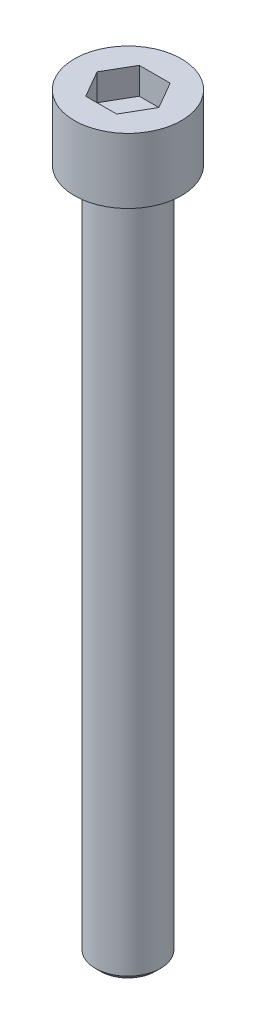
ISO-10303-21;
HEADER;
FILE_DESCRIPTION(('STEP AP214'),'2;1');
FILE_NAME('part.step','',(''),(''),'','','');
FILE_SCHEMA(('AUTOMOTIVE_DESIGN { 1 0 10303 214 1 1 1 1 }'));
ENDSEC;
DATA;
#1=APPLICATION_CONTEXT('core data for automotive mechanical design processes');
#2=APPLICATION_PROTOCOL_DEFINITION('international standard','automotive_design',2000,#1);
#3=PRODUCT_CONTEXT('',#1,'mechanical');
#4=PRODUCT('Part','Part','',(#3));
#5=PRODUCT_RELATED_PRODUCT_CATEGORY('part','',(#4));
#6=PRODUCT_DEFINITION_FORMATION('','',#4);
#7=PRODUCT_DEFINITION_CONTEXT('part definition',#1,'design');
#8=PRODUCT_DEFINITION('design','',#6,#7);
#9=PRODUCT_DEFINITION_SHAPE('','',#8);
#10=(LENGTH_UNIT() NAMED_UNIT(*) SI_UNIT(.MILLI.,.METRE.));
#11=(NAMED_UNIT(*) PLANE_ANGLE_UNIT() SI_UNIT($,.RADIAN.));
#12=(NAMED_UNIT(*) SI_UNIT($,.STERADIAN.) SOLID_ANGLE_UNIT());
#13=UNCERTAINTY_MEASURE_WITH_UNIT(LENGTH_MEASURE(1.E-05),#10,'distance_accuracy_value','');
#14=(GEOMETRIC_REPRESENTATION_CONTEXT(3) GLOBAL_UNCERTAINTY_ASSIGNED_CONTEXT((#13)) GLOBAL_UNIT_ASSIGNED_CONTEXT((#10,
#11,#12)) REPRESENTATION_CONTEXT('',''));
#15=CARTESIAN_POINT('',(0.,0.,0.));
#16=DIRECTION('',(0.,0.,1.));
#17=DIRECTION('',(1.,0.,0.));
#18=AXIS2_PLACEMENT_3D('',#15,#16,#17);
#19=CARTESIAN_POINT('',(0.,4.826,0.));
#20=DIRECTION('',(0.,-1.,0.));
#21=DIRECTION('',(0.,0.,-1.));
#22=AXIS2_PLACEMENT_3D('',#19,#20,#21);
#23=PLANE('',#22);
#24=DIRECTION('',(-0.5,0.,-0.866025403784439));
#25=VECTOR('',#24,1.);
#26=CARTESIAN_POINT('',(2.29135888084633,4.826,0.));
#27=LINE('',#26,#25);
#28=CARTESIAN_POINT('',(2.29135888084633,4.826,0.));
#29=VERTEX_POINT('',#28);
#30=CARTESIAN_POINT('',(1.14567944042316,4.826,-1.984375));
#31=VERTEX_POINT('',#30);
#32=EDGE_CURVE('E118',#29,#31,#27,.T.);
#33=ORIENTED_EDGE('',*,*,#32,.F.);
#34=DIRECTION('',(0.5,0.,-0.866025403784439));
#35=VECTOR('',#34,1.);
#36=CARTESIAN_POINT('',(1.14567944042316,4.826,1.984375));
#37=LINE('',#36,#35);
#38=CARTESIAN_POINT('',(1.14567944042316,4.826,1.984375));
#39=VERTEX_POINT('',#38);
#40=EDGE_CURVE('E44',#39,#29,#37,.T.);
#41=ORIENTED_EDGE('',*,*,#40,.F.);
#42=DIRECTION('',(1.,0.,0.));
#43=VECTOR('',#42,1.);
#44=CARTESIAN_POINT('',(-1.14567944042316,4.826,1.984375));
#45=LINE('',#44,#43);
#46=CARTESIAN_POINT('',(-1.14567944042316,4.826,1.984375));
#47=VERTEX_POINT('',#46);
#48=EDGE_CURVE('E127',#47,#39,#45,.T.);
#49=ORIENTED_EDGE('',*,*,#48,.F.);
#50=DIRECTION('',(0.5,0.,0.866025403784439));
#51=VECTOR('',#50,1.);
#52=CARTESIAN_POINT('',(-2.29135888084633,4.826,0.));
#53=LINE('',#52,#51);
#54=CARTESIAN_POINT('',(-2.29135888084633,4.826,0.));
#55=VERTEX_POINT('',#54);
#56=EDGE_CURVE('E125',#55,#47,#53,.T.);
#57=ORIENTED_EDGE('',*,*,#56,.F.);
#58=DIRECTION('',(-0.5,0.,0.866025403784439));
#59=VECTOR('',#58,1.);
#60=CARTESIAN_POINT('',(-1.14567944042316,4.826,-1.984375));
#61=LINE('',#60,#59);
#62=CARTESIAN_POINT('',(-1.14567944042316,4.826,-1.984375));
#63=VERTEX_POINT('',#62);
#64=EDGE_CURVE('E92',#63,#55,#61,.T.);
#65=ORIENTED_EDGE('',*,*,#64,.F.);
#66=DIRECTION('',(-1.,0.,0.));
#67=VECTOR('',#66,1.);
#68=CARTESIAN_POINT('',(1.14567944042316,4.826,-1.984375));
#69=LINE('',#68,#67);
#70=EDGE_CURVE('E121',#31,#63,#69,.T.);
#71=ORIENTED_EDGE('',*,*,#70,.F.);
#72=EDGE_LOOP('',(#33,#41,#49,#57,#65,#71));
#73=FACE_BOUND('',#72,.T.);
#74=CARTESIAN_POINT('',(0.,4.826,0.));
#75=DIRECTION('',(0.,1.,0.));
#76=DIRECTION('',(0.,0.,1.));
#77=AXIS2_PLACEMENT_3D('',#74,#75,#76);
#78=CIRCLE('',#77,3.96875);
#79=CARTESIAN_POINT('',(0.,4.826,3.96875));
#80=VERTEX_POINT('',#79);
#81=EDGE_CURVE('E11',#80,#80,#78,.T.);
#82=ORIENTED_EDGE('',*,*,#81,.T.);
#83=EDGE_LOOP('',(#82));
#84=FACE_BOUND('',#83,.T.);
#85=ADVANCED_FACE('F30',(#73,#84),#23,.F.);
#86=CARTESIAN_POINT('',(0.,17.272,0.));
#87=DIRECTION('',(0.,1.,0.));
#88=DIRECTION('',(0.,0.,1.));
#89=AXIS2_PLACEMENT_3D('',#86,#87,#88);
#90=CYLINDRICAL_SURFACE('',#89,3.96875);
#91=ORIENTED_EDGE('',*,*,#81,.F.);
#92=EDGE_LOOP('',(#91));
#93=FACE_BOUND('',#92,.T.);
#94=CARTESIAN_POINT('',(0.,0.,0.));
#95=DIRECTION('',(0.,1.,0.));
#96=DIRECTION('',(0.,0.,1.));
#97=AXIS2_PLACEMENT_3D('',#94,#95,#96);
#98=CIRCLE('',#97,3.96875);
#99=CARTESIAN_POINT('',(0.,0.,3.96875));
#100=VERTEX_POINT('',#99);
#101=EDGE_CURVE('E37',#100,#100,#98,.T.);
#102=ORIENTED_EDGE('',*,*,#101,.T.);
#103=EDGE_LOOP('',(#102));
#104=FACE_BOUND('',#103,.T.);
#105=ADVANCED_FACE('F147',(#93,#104),#90,.T.);
#106=CARTESIAN_POINT('',(3.96875,0.,0.));
#107=DIRECTION('',(0.,1.,0.));
#108=DIRECTION('',(0.,0.,1.));
#109=AXIS2_PLACEMENT_3D('',#106,#107,#108);
#110=PLANE('',#109);
#111=ORIENTED_EDGE('',*,*,#101,.F.);
#112=EDGE_LOOP('',(#111));
#113=FACE_BOUND('',#112,.T.);
#114=CARTESIAN_POINT('',(0.,0.,0.));
#115=DIRECTION('',(0.,1.,0.));
#116=DIRECTION('',(0.,0.,1.));
#117=AXIS2_PLACEMENT_3D('',#114,#115,#116);
#118=CIRCLE('',#117,2.413);
#119=CARTESIAN_POINT('',(0.,0.,2.413));
#120=VERTEX_POINT('',#119);
#121=EDGE_CURVE('E142',#120,#120,#118,.T.);
#122=ORIENTED_EDGE('',*,*,#121,.T.);
#123=EDGE_LOOP('',(#122));
#124=FACE_BOUND('',#123,.T.);
#125=ADVANCED_FACE('F149',(#113,#124),#110,.F.);
#126=CARTESIAN_POINT('',(0.,17.272,0.));
#127=DIRECTION('',(0.,1.,0.));
#128=DIRECTION('',(0.,0.,1.));
#129=AXIS2_PLACEMENT_3D('',#126,#127,#128);
#130=CYLINDRICAL_SURFACE('',#129,2.41300000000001);
#131=ORIENTED_EDGE('',*,*,#121,.F.);
#132=EDGE_LOOP('',(#131));
#133=FACE_BOUND('',#132,.T.);
#134=CARTESIAN_POINT('',(0.,-50.403125,0.));
#135=DIRECTION('',(0.,1.,0.));
#136=DIRECTION('',(0.,0.,1.));
#137=AXIS2_PLACEMENT_3D('',#134,#135,#136);
#138=CIRCLE('',#137,2.41300000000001);
#139=CARTESIAN_POINT('',(0.,-50.403125,2.41300000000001));
#140=VERTEX_POINT('',#139);
#141=EDGE_CURVE('E139',#140,#140,#138,.T.);
#142=ORIENTED_EDGE('',*,*,#141,.T.);
#143=EDGE_LOOP('',(#142));
#144=FACE_BOUND('',#143,.T.);
#145=ADVANCED_FACE('F152',(#133,#144),#130,.T.);
#146=CARTESIAN_POINT('',(0.,-50.8,0.));
#147=DIRECTION('',(0.,1.,0.));
#148=DIRECTION('',(0.,0.,1.));
#149=AXIS2_PLACEMENT_3D('',#146,#147,#148);
#150=CONICAL_SURFACE('',#149,2.01612500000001,0.785398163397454);
#151=ORIENTED_EDGE('',*,*,#141,.F.);
#152=EDGE_LOOP('',(#151));
#153=FACE_BOUND('',#152,.T.);
#154=CARTESIAN_POINT('',(0.,-50.8,0.));
#155=DIRECTION('',(0.,1.,0.));
#156=DIRECTION('',(0.,0.,1.));
#157=AXIS2_PLACEMENT_3D('',#154,#155,#156);
#158=CIRCLE('',#157,2.01612500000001);
#159=CARTESIAN_POINT('',(0.,-50.8,2.01612500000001));
#160=VERTEX_POINT('',#159);
#161=EDGE_CURVE('E131',#160,#160,#158,.T.);
#162=ORIENTED_EDGE('',*,*,#161,.T.);
#163=EDGE_LOOP('',(#162));
#164=FACE_BOUND('',#163,.T.);
#165=ADVANCED_FACE('F158',(#153,#164),#150,.T.);
#166=CARTESIAN_POINT('',(2.01612500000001,-50.8,0.));
#167=DIRECTION('',(0.,1.,0.));
#168=DIRECTION('',(0.,0.,1.));
#169=AXIS2_PLACEMENT_3D('',#166,#167,#168);
#170=PLANE('',#169);
#171=ORIENTED_EDGE('',*,*,#161,.F.);
#172=EDGE_LOOP('',(#171));
#173=FACE_BOUND('',#172,.T.);
#174=ADVANCED_FACE('F164',(#173),#170,.F.);
#175=CARTESIAN_POINT('',(1.14567944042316,2.841625,1.984375));
#176=DIRECTION('',(0.866025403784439,0.,0.5));
#177=DIRECTION('',(0.5,0.,-0.866025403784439));
#178=AXIS2_PLACEMENT_3D('',#175,#176,#177);
#179=PLANE('',#178);
#180=ORIENTED_EDGE('',*,*,#40,.T.);
#181=DIRECTION('',(0.,1.,0.));
#182=VECTOR('',#181,1.);
#183=CARTESIAN_POINT('',(2.29135888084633,2.841625,0.));
#184=LINE('',#183,#182);
#185=CARTESIAN_POINT('',(2.29135888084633,2.841625,0.));
#186=VERTEX_POINT('',#185);
#187=EDGE_CURVE('E74',#186,#29,#184,.T.);
#188=ORIENTED_EDGE('',*,*,#187,.F.);
#189=DIRECTION('',(0.5,0.,-0.866025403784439));
#190=VECTOR('',#189,1.);
#191=CARTESIAN_POINT('',(1.14567944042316,2.841625,1.984375));
#192=LINE('',#191,#190);
#193=CARTESIAN_POINT('',(1.14567944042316,2.841625,1.984375));
#194=VERTEX_POINT('',#193);
#195=EDGE_CURVE('E129',#194,#186,#192,.T.);
#196=ORIENTED_EDGE('',*,*,#195,.F.);
#197=DIRECTION('',(0.,1.,0.));
#198=VECTOR('',#197,1.);
#199=CARTESIAN_POINT('',(1.14567944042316,2.841625,1.984375));
#200=LINE('',#199,#198);
#201=EDGE_CURVE('E52',#194,#39,#200,.T.);
#202=ORIENTED_EDGE('',*,*,#201,.T.);
#203=EDGE_LOOP('',(#180,#188,#196,#202));
#204=FACE_BOUND('',#203,.T.);
#205=ADVANCED_FACE('F169',(#204),#179,.F.);
#206=CARTESIAN_POINT('',(-1.14567944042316,2.841625,1.984375));
#207=DIRECTION('',(0.,0.,1.));
#208=DIRECTION('',(1.,0.,0.));
#209=AXIS2_PLACEMENT_3D('',#206,#207,#208);
#210=PLANE('',#209);
#211=ORIENTED_EDGE('',*,*,#48,.T.);
#212=ORIENTED_EDGE('',*,*,#201,.F.);
#213=DIRECTION('',(1.,0.,0.));
#214=VECTOR('',#213,1.);
#215=CARTESIAN_POINT('',(-1.14567944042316,2.841625,1.984375));
#216=LINE('',#215,#214);
#217=CARTESIAN_POINT('',(-1.14567944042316,2.841625,1.984375));
#218=VERTEX_POINT('',#217);
#219=EDGE_CURVE('E104',#218,#194,#216,.T.);
#220=ORIENTED_EDGE('',*,*,#219,.F.);
#221=DIRECTION('',(0.,1.,0.));
#222=VECTOR('',#221,1.);
#223=CARTESIAN_POINT('',(-1.14567944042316,2.841625,1.984375));
#224=LINE('',#223,#222);
#225=EDGE_CURVE('E96',#218,#47,#224,.T.);
#226=ORIENTED_EDGE('',*,*,#225,.T.);
#227=EDGE_LOOP('',(#211,#212,#220,#226));
#228=FACE_BOUND('',#227,.T.);
#229=ADVANCED_FACE('F174',(#228),#210,.F.);
#230=CARTESIAN_POINT('',(-2.29135888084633,2.841625,0.));
#231=DIRECTION('',(-0.866025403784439,0.,0.5));
#232=DIRECTION('',(0.5,0.,0.866025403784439));
#233=AXIS2_PLACEMENT_3D('',#230,#231,#232);
#234=PLANE('',#233);
#235=ORIENTED_EDGE('',*,*,#56,.T.);
#236=ORIENTED_EDGE('',*,*,#225,.F.);
#237=DIRECTION('',(0.5,0.,0.866025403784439));
#238=VECTOR('',#237,1.);
#239=CARTESIAN_POINT('',(-2.29135888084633,2.841625,0.));
#240=LINE('',#239,#238);
#241=CARTESIAN_POINT('',(-2.29135888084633,2.841625,0.));
#242=VERTEX_POINT('',#241);
#243=EDGE_CURVE('E100',#242,#218,#240,.T.);
#244=ORIENTED_EDGE('',*,*,#243,.F.);
#245=DIRECTION('',(0.,1.,0.));
#246=VECTOR('',#245,1.);
#247=CARTESIAN_POINT('',(-2.29135888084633,2.841625,0.));
#248=LINE('',#247,#246);
#249=EDGE_CURVE('E85',#242,#55,#248,.T.);
#250=ORIENTED_EDGE('',*,*,#249,.T.);
#251=EDGE_LOOP('',(#235,#236,#244,#250));
#252=FACE_BOUND('',#251,.T.);
#253=ADVANCED_FACE('F101',(#252),#234,.F.);
#254=CARTESIAN_POINT('',(-1.14567944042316,2.841625,-1.984375));
#255=DIRECTION('',(-0.866025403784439,0.,-0.5));
#256=DIRECTION('',(-0.5,0.,0.866025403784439));
#257=AXIS2_PLACEMENT_3D('',#254,#255,#256);
#258=PLANE('',#257);
#259=ORIENTED_EDGE('',*,*,#64,.T.);
#260=ORIENTED_EDGE('',*,*,#249,.F.);
#261=DIRECTION('',(-0.5,0.,0.866025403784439));
#262=VECTOR('',#261,1.);
#263=CARTESIAN_POINT('',(-1.14567944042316,2.841625,-1.984375));
#264=LINE('',#263,#262);
#265=CARTESIAN_POINT('',(-1.14567944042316,2.841625,-1.984375));
#266=VERTEX_POINT('',#265);
#267=EDGE_CURVE('E89',#266,#242,#264,.T.);
#268=ORIENTED_EDGE('',*,*,#267,.F.);
#269=DIRECTION('',(0.,1.,0.));
#270=VECTOR('',#269,1.);
#271=CARTESIAN_POINT('',(-1.14567944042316,2.841625,-1.984375));
#272=LINE('',#271,#270);
#273=EDGE_CURVE('E97',#266,#63,#272,.T.);
#274=ORIENTED_EDGE('',*,*,#273,.T.);
#275=EDGE_LOOP('',(#259,#260,#268,#274));
#276=FACE_BOUND('',#275,.T.);
#277=ADVANCED_FACE('F87',(#276),#258,.F.);
#278=CARTESIAN_POINT('',(1.14567944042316,2.841625,-1.984375));
#279=DIRECTION('',(0.,0.,-1.));
#280=DIRECTION('',(-1.,0.,0.));
#281=AXIS2_PLACEMENT_3D('',#278,#279,#280);
#282=PLANE('',#281);
#283=ORIENTED_EDGE('',*,*,#70,.T.);
#284=ORIENTED_EDGE('',*,*,#273,.F.);
#285=DIRECTION('',(-1.,0.,0.));
#286=VECTOR('',#285,1.);
#287=CARTESIAN_POINT('',(1.14567944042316,2.841625,-1.984375));
#288=LINE('',#287,#286);
#289=CARTESIAN_POINT('',(1.14567944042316,2.841625,-1.984375));
#290=VERTEX_POINT('',#289);
#291=EDGE_CURVE('E110',#290,#266,#288,.T.);
#292=ORIENTED_EDGE('',*,*,#291,.F.);
#293=DIRECTION('',(0.,1.,0.));
#294=VECTOR('',#293,1.);
#295=CARTESIAN_POINT('',(1.14567944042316,2.841625,-1.984375));
#296=LINE('',#295,#294);
#297=EDGE_CURVE('E134',#290,#31,#296,.T.);
#298=ORIENTED_EDGE('',*,*,#297,.T.);
#299=EDGE_LOOP('',(#283,#284,#292,#298));
#300=FACE_BOUND('',#299,.T.);
#301=ADVANCED_FACE('F200',(#300),#282,.F.);
#302=CARTESIAN_POINT('',(2.29135888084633,2.841625,0.));
#303=DIRECTION('',(0.866025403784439,0.,-0.5));
#304=DIRECTION('',(-0.5,0.,-0.866025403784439));
#305=AXIS2_PLACEMENT_3D('',#302,#303,#304);
#306=PLANE('',#305);
#307=ORIENTED_EDGE('',*,*,#32,.T.);
#308=ORIENTED_EDGE('',*,*,#297,.F.);
#309=DIRECTION('',(-0.5,0.,-0.866025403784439));
#310=VECTOR('',#309,1.);
#311=CARTESIAN_POINT('',(2.29135888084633,2.841625,0.));
#312=LINE('',#311,#310);
#313=EDGE_CURVE('E112',#186,#290,#312,.T.);
#314=ORIENTED_EDGE('',*,*,#313,.F.);
#315=ORIENTED_EDGE('',*,*,#187,.T.);
#316=EDGE_LOOP('',(#307,#308,#314,#315));
#317=FACE_BOUND('',#316,.T.);
#318=ADVANCED_FACE('F188',(#317),#306,.F.);
#319=CARTESIAN_POINT('',(3.43703832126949,2.841625,-1.984375));
#320=DIRECTION('',(0.,1.,0.));
#321=DIRECTION('',(0.,0.,1.));
#322=AXIS2_PLACEMENT_3D('',#319,#320,#321);
#323=PLANE('',#322);
#324=ORIENTED_EDGE('',*,*,#195,.T.);
#325=ORIENTED_EDGE('',*,*,#313,.T.);
#326=ORIENTED_EDGE('',*,*,#291,.T.);
#327=ORIENTED_EDGE('',*,*,#267,.T.);
#328=ORIENTED_EDGE('',*,*,#243,.T.);
#329=ORIENTED_EDGE('',*,*,#219,.T.);
#330=EDGE_LOOP('',(#324,#325,#326,#327,#328,#329));
#331=FACE_BOUND('',#330,.T.);
#332=ADVANCED_FACE('F107',(#331),#323,.T.);
#333=CLOSED_SHELL('',(#85,#105,#125,#145,#165,#174,#205,#229,#253,#277,#301,#318,#332));
#334=MANIFOLD_SOLID_BREP('B2',#333);
#335=ADVANCED_BREP_SHAPE_REPRESENTATION('',(#18,#334),#14);
#336=SHAPE_DEFINITION_REPRESENTATION(#9,#335);
ENDSEC;
END-ISO-10303-21;
